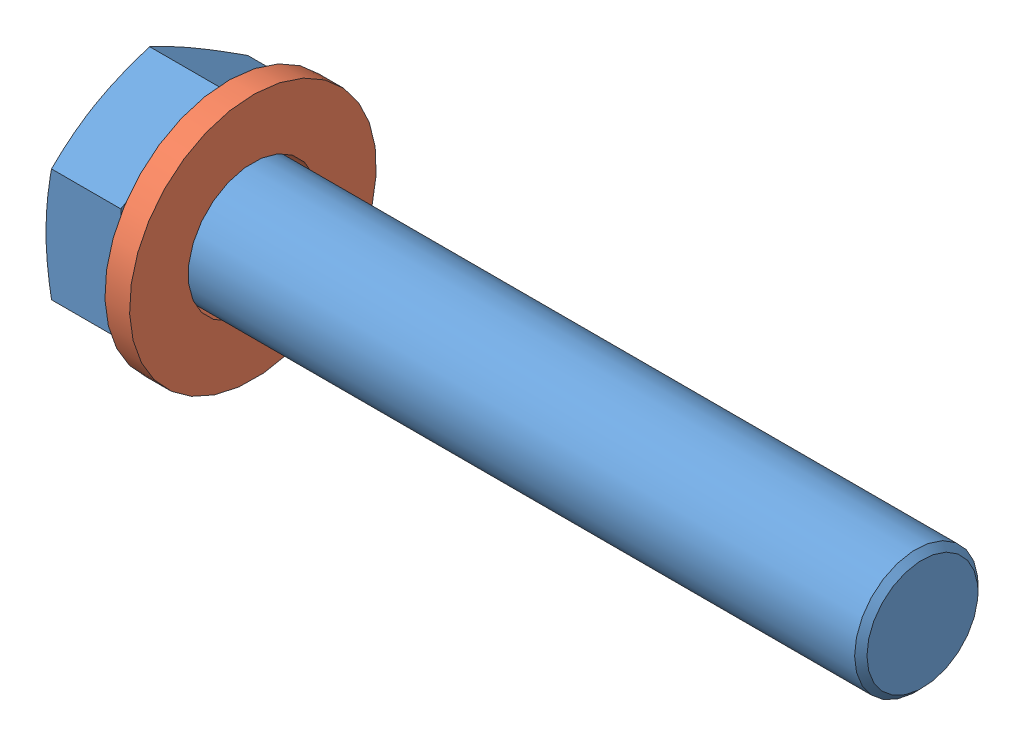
SolidWorks assembly Assemblage2.sldasm, configuration Défaut (file format 3400). Lengths in mm.
Overall size (50.45 20.9 20.9).
2 component instances, 2 part files, 2 mates.
Components (placement in the parent):
- Vis M8 45 mm-1: Vis M8 45 mm.SLDPRT [GB_FASTENER_BOLT_STBAB A M8X45-C] at origin size (50.45 14.7 12.73)
- Rondelle M8-1: Rondelle M8.SLDPRT [Washer ISO 7089 - 8] at (5.45 0 0) x (-1 0 0) z (0 0.924225 0.381849) size (1.6 16 16)
Mates (geometry in assembly coordinates):
- Coaxiale11: concentric: cylinder of ?; cylinder of ?
- Coïncidente11: coincident anti-aligned: plane of ?; plane of ?
